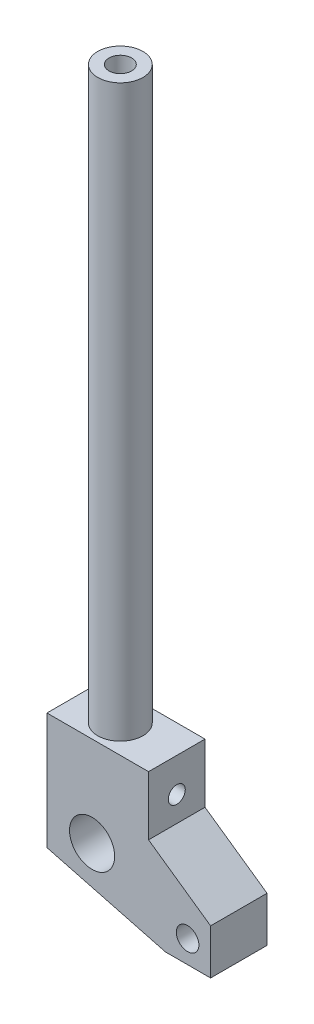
from build123d import *

# Parameters (mm, degrees)
SKETCH2_R           = 3.175
SKETCH2_R_2         = 6.35
BOSS_EXTRUDE1_DEPTH = 7.9375
CUT_EXTRUDE1_START  = 7.9248
SKETCH3_R           = 6.35
CUT_EXTRUDE1_DEPTH  = 25.4
SKETCH5_R           = 2.3876
CUT_EXTRUDE2_DEPTH  = 25.4
SKETCH6_R           = 3.9624
CUT_EXTRUDE3_DEPTH  = 25.4
EXTRUDE_THIN1_START = 7.9248
SKETCH7_R           = 6.35
SKETCH7_R_2         = 3.175
EXTRUDE_THIN1_DEPTH = 177.8
SKETCH9_R           = 2.3876
CUT_EXTRUDE4_DEPTH  = 6.35


with BuildPart() as part:
    # Sketch2 → Boss-Extrude1 (new, symmetric)
    with BuildSketch(Plane.XY):
        Polygon((20.6248, -16.129), (33.3248, -16.129), (33.3248, -3.429), (15.875, 8.7894815), (15.875, 25.4), (-12.7, 25.4), (-12.7, -7.3914), align=None)
        with Locations((26.851716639, -9.773225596)):
            Circle(SKETCH2_R, mode=Mode.SUBTRACT)
        Circle(SKETCH2_R_2, mode=Mode.SUBTRACT)
    extrude(amount=BOSS_EXTRUDE1_DEPTH, both=True)

    # Sketch3 → Cut-Extrude1 (cut)
    with BuildSketch(Plane(origin=(0, 0, 0), x_dir=(1, 0, 0), z_dir=(0, 1, 0)).offset(CUT_EXTRUDE1_START)):
        Circle(SKETCH3_R)
    extrude(amount=CUT_EXTRUDE1_DEPTH, mode=Mode.SUBTRACT)

    # Sketch5 → Cut-Extrude2 (cut)
    with BuildSketch(Plane(origin=(0, 0, 0), x_dir=(0, 0, -1), z_dir=(1, 0, 0))):
        with Locations(Location((0, 15.875, 0), (0, 0, 270.000000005))):
            Circle(SKETCH5_R)
    extrude(amount=CUT_EXTRUDE2_DEPTH, mode=Mode.SUBTRACT)

    # Sketch6 → Cut-Extrude3 (cut)
    with BuildSketch(Plane(origin=(0, 0, 0), x_dir=(0, 0, -1), z_dir=(1, 0, 0))):
        with Locations((0, 15.875)):
            Circle(SKETCH6_R)
    extrude(amount=-CUT_EXTRUDE3_DEPTH, mode=Mode.SUBTRACT)


with BuildPart() as body_2:
    # Sketch7 → Extrude-Thin1 (new body)
    with BuildSketch(Plane(origin=(0, 0, 0), x_dir=(1, 0, 0), z_dir=(0, 1, 0)).offset(EXTRUDE_THIN1_START)):
        Circle(SKETCH7_R)
        Circle(SKETCH7_R_2, mode=Mode.SUBTRACT)
    extrude(amount=EXTRUDE_THIN1_DEPTH)

    # Sketch9 → Cut-Extrude4 (cut, symmetric)
    with BuildSketch(Plane(origin=(0, 0, 0), x_dir=(0, 0, -1), z_dir=(1, 0, 0))):
        with Locations((0, 15.875)):
            Circle(SKETCH9_R)
    extrude(amount=CUT_EXTRUDE4_DEPTH, both=True, mode=Mode.SUBTRACT)


solid = Compound([part.part, body_2.part])
